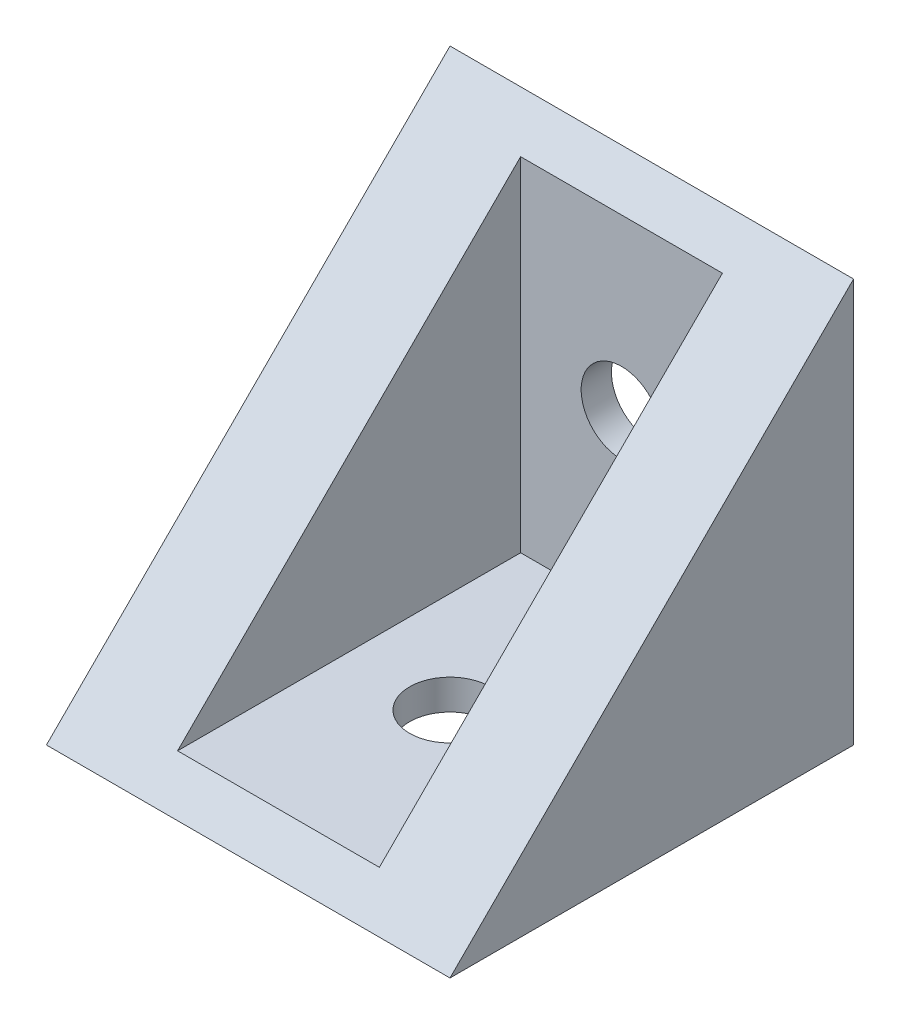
ISO-10303-21;
HEADER;
FILE_DESCRIPTION(('STEP AP214'),'2;1');
FILE_NAME('part.step','',(''),(''),'','','');
FILE_SCHEMA(('AUTOMOTIVE_DESIGN { 1 0 10303 214 1 1 1 1 }'));
ENDSEC;
DATA;
#1=APPLICATION_CONTEXT('core data for automotive mechanical design processes');
#2=APPLICATION_PROTOCOL_DEFINITION('international standard','automotive_design',2000,#1);
#3=PRODUCT_CONTEXT('',#1,'mechanical');
#4=PRODUCT('Part','Part','',(#3));
#5=PRODUCT_RELATED_PRODUCT_CATEGORY('part','',(#4));
#6=PRODUCT_DEFINITION_FORMATION('','',#4);
#7=PRODUCT_DEFINITION_CONTEXT('part definition',#1,'design');
#8=PRODUCT_DEFINITION('design','',#6,#7);
#9=PRODUCT_DEFINITION_SHAPE('','',#8);
#10=(LENGTH_UNIT() NAMED_UNIT(*) SI_UNIT(.MILLI.,.METRE.));
#11=(NAMED_UNIT(*) PLANE_ANGLE_UNIT() SI_UNIT($,.RADIAN.));
#12=(NAMED_UNIT(*) SI_UNIT($,.STERADIAN.) SOLID_ANGLE_UNIT());
#13=UNCERTAINTY_MEASURE_WITH_UNIT(LENGTH_MEASURE(1.E-05),#10,'distance_accuracy_value','');
#14=(GEOMETRIC_REPRESENTATION_CONTEXT(3) GLOBAL_UNCERTAINTY_ASSIGNED_CONTEXT((#13)) GLOBAL_UNIT_ASSIGNED_CONTEXT((#10,
#11,#12)) REPRESENTATION_CONTEXT('',''));
#15=CARTESIAN_POINT('',(0.,0.,0.));
#16=DIRECTION('',(0.,0.,1.));
#17=DIRECTION('',(1.,0.,0.));
#18=AXIS2_PLACEMENT_3D('',#15,#16,#17);
#19=CARTESIAN_POINT('',(20.,20.,0.));
#20=DIRECTION('',(0.,-0.707106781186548,-0.707106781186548));
#21=DIRECTION('',(0.,0.707106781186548,-0.707106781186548));
#22=AXIS2_PLACEMENT_3D('',#19,#20,#21);
#23=PLANE('',#22);
#24=DIRECTION('',(1.,0.,0.));
#25=VECTOR('',#24,1.);
#26=CARTESIAN_POINT('',(20.,1.5,18.5));
#27=LINE('',#26,#25);
#28=CARTESIAN_POINT('',(5.,1.5,18.5));
#29=VERTEX_POINT('',#28);
#30=CARTESIAN_POINT('',(15.,1.5,18.5));
#31=VERTEX_POINT('',#30);
#32=EDGE_CURVE('E113',#29,#31,#27,.T.);
#33=ORIENTED_EDGE('',*,*,#32,.F.);
#34=DIRECTION('',(0.,0.707106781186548,-0.707106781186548));
#35=VECTOR('',#34,1.);
#36=CARTESIAN_POINT('',(5.,20.,0.));
#37=LINE('',#36,#35);
#38=CARTESIAN_POINT('',(5.,18.5,1.5));
#39=VERTEX_POINT('',#38);
#40=EDGE_CURVE('E11',#29,#39,#37,.T.);
#41=ORIENTED_EDGE('',*,*,#40,.T.);
#42=DIRECTION('',(1.,0.,0.));
#43=VECTOR('',#42,1.);
#44=CARTESIAN_POINT('',(20.,18.5,1.5));
#45=LINE('',#44,#43);
#46=CARTESIAN_POINT('',(15.,18.5,1.5));
#47=VERTEX_POINT('',#46);
#48=EDGE_CURVE('E52',#39,#47,#45,.T.);
#49=ORIENTED_EDGE('',*,*,#48,.T.);
#50=DIRECTION('',(0.,-0.707106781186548,0.707106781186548));
#51=VECTOR('',#50,1.);
#52=CARTESIAN_POINT('',(15.,20.,0.));
#53=LINE('',#52,#51);
#54=EDGE_CURVE('E122',#47,#31,#53,.T.);
#55=ORIENTED_EDGE('',*,*,#54,.T.);
#56=EDGE_LOOP('',(#33,#41,#49,#55));
#57=FACE_BOUND('',#56,.T.);
#58=DIRECTION('',(0.,-0.707106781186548,0.707106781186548));
#59=VECTOR('',#58,1.);
#60=CARTESIAN_POINT('',(0.,20.,0.));
#61=LINE('',#60,#59);
#62=CARTESIAN_POINT('',(0.,20.,0.));
#63=VERTEX_POINT('',#62);
#64=CARTESIAN_POINT('',(0.,0.,20.));
#65=VERTEX_POINT('',#64);
#66=EDGE_CURVE('E132',#63,#65,#61,.T.);
#67=ORIENTED_EDGE('',*,*,#66,.T.);
#68=DIRECTION('',(-1.,0.,0.));
#69=VECTOR('',#68,1.);
#70=CARTESIAN_POINT('',(20.,0.,20.));
#71=LINE('',#70,#69);
#72=CARTESIAN_POINT('',(20.,0.,20.));
#73=VERTEX_POINT('',#72);
#74=EDGE_CURVE('E156',#73,#65,#71,.T.);
#75=ORIENTED_EDGE('',*,*,#74,.F.);
#76=DIRECTION('',(0.,-0.707106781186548,0.707106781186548));
#77=VECTOR('',#76,1.);
#78=CARTESIAN_POINT('',(20.,20.,0.));
#79=LINE('',#78,#77);
#80=CARTESIAN_POINT('',(20.,20.,0.));
#81=VERTEX_POINT('',#80);
#82=EDGE_CURVE('E139',#81,#73,#79,.T.);
#83=ORIENTED_EDGE('',*,*,#82,.F.);
#84=DIRECTION('',(-1.,0.,0.));
#85=VECTOR('',#84,1.);
#86=CARTESIAN_POINT('',(20.,20.,0.));
#87=LINE('',#86,#85);
#88=EDGE_CURVE('E141',#81,#63,#87,.T.);
#89=ORIENTED_EDGE('',*,*,#88,.T.);
#90=EDGE_LOOP('',(#67,#75,#83,#89));
#91=FACE_BOUND('',#90,.T.);
#92=ADVANCED_FACE('F44',(#57,#91),#23,.F.);
#93=CARTESIAN_POINT('',(20.,0.,20.));
#94=DIRECTION('',(0.,1.,0.));
#95=DIRECTION('',(0.,0.,1.));
#96=AXIS2_PLACEMENT_3D('',#93,#94,#95);
#97=PLANE('',#96);
#98=CARTESIAN_POINT('',(10.,0.,10.));
#99=DIRECTION('',(0.,1.,0.));
#100=DIRECTION('',(0.,0.,1.));
#101=AXIS2_PLACEMENT_3D('',#98,#99,#100);
#102=CIRCLE('',#101,2.);
#103=CARTESIAN_POINT('',(10.,0.,12.));
#104=VERTEX_POINT('',#103);
#105=EDGE_CURVE('E169',#104,#104,#102,.T.);
#106=ORIENTED_EDGE('',*,*,#105,.T.);
#107=EDGE_LOOP('',(#106));
#108=FACE_BOUND('',#107,.T.);
#109=DIRECTION('',(0.,0.,-1.));
#110=VECTOR('',#109,1.);
#111=CARTESIAN_POINT('',(0.,0.,20.));
#112=LINE('',#111,#110);
#113=CARTESIAN_POINT('',(0.,0.,0.));
#114=VERTEX_POINT('',#113);
#115=EDGE_CURVE('E150',#65,#114,#112,.T.);
#116=ORIENTED_EDGE('',*,*,#115,.T.);
#117=DIRECTION('',(-1.,0.,0.));
#118=VECTOR('',#117,1.);
#119=CARTESIAN_POINT('',(20.,0.,0.));
#120=LINE('',#119,#118);
#121=CARTESIAN_POINT('',(20.,0.,0.));
#122=VERTEX_POINT('',#121);
#123=EDGE_CURVE('E152',#122,#114,#120,.T.);
#124=ORIENTED_EDGE('',*,*,#123,.F.);
#125=DIRECTION('',(0.,0.,-1.));
#126=VECTOR('',#125,1.);
#127=CARTESIAN_POINT('',(20.,0.,20.));
#128=LINE('',#127,#126);
#129=EDGE_CURVE('E91',#73,#122,#128,.T.);
#130=ORIENTED_EDGE('',*,*,#129,.F.);
#131=ORIENTED_EDGE('',*,*,#74,.T.);
#132=EDGE_LOOP('',(#116,#124,#130,#131));
#133=FACE_BOUND('',#132,.T.);
#134=ADVANCED_FACE('F205',(#108,#133),#97,.F.);
#135=CARTESIAN_POINT('',(20.,0.,0.));
#136=DIRECTION('',(0.,0.,1.));
#137=DIRECTION('',(1.,0.,0.));
#138=AXIS2_PLACEMENT_3D('',#135,#136,#137);
#139=PLANE('',#138);
#140=CARTESIAN_POINT('',(10.,10.,0.));
#141=DIRECTION('',(0.,0.,1.));
#142=DIRECTION('',(1.,0.,0.));
#143=AXIS2_PLACEMENT_3D('',#140,#141,#142);
#144=CIRCLE('',#143,2.);
#145=CARTESIAN_POINT('',(12.,10.,0.));
#146=VERTEX_POINT('',#145);
#147=EDGE_CURVE('E178',#146,#146,#144,.T.);
#148=ORIENTED_EDGE('',*,*,#147,.T.);
#149=EDGE_LOOP('',(#148));
#150=FACE_BOUND('',#149,.T.);
#151=DIRECTION('',(0.,1.,0.));
#152=VECTOR('',#151,1.);
#153=CARTESIAN_POINT('',(0.,0.,0.));
#154=LINE('',#153,#152);
#155=EDGE_CURVE('E86',#114,#63,#154,.T.);
#156=ORIENTED_EDGE('',*,*,#155,.T.);
#157=ORIENTED_EDGE('',*,*,#88,.F.);
#158=DIRECTION('',(0.,1.,0.));
#159=VECTOR('',#158,1.);
#160=CARTESIAN_POINT('',(20.,0.,0.));
#161=LINE('',#160,#159);
#162=EDGE_CURVE('E67',#122,#81,#161,.T.);
#163=ORIENTED_EDGE('',*,*,#162,.F.);
#164=ORIENTED_EDGE('',*,*,#123,.T.);
#165=EDGE_LOOP('',(#156,#157,#163,#164));
#166=FACE_BOUND('',#165,.T.);
#167=ADVANCED_FACE('F206',(#150,#166),#139,.F.);
#168=CARTESIAN_POINT('',(20.,0.,0.));
#169=DIRECTION('',(1.,0.,0.));
#170=DIRECTION('',(0.,0.,-1.));
#171=AXIS2_PLACEMENT_3D('',#168,#169,#170);
#172=PLANE('',#171);
#173=ORIENTED_EDGE('',*,*,#82,.T.);
#174=ORIENTED_EDGE('',*,*,#129,.T.);
#175=ORIENTED_EDGE('',*,*,#162,.T.);
#176=EDGE_LOOP('',(#173,#174,#175));
#177=FACE_BOUND('',#176,.T.);
#178=ADVANCED_FACE('F214',(#177),#172,.T.);
#179=CARTESIAN_POINT('',(0.,0.,0.));
#180=DIRECTION('',(1.,0.,0.));
#181=DIRECTION('',(0.,0.,-1.));
#182=AXIS2_PLACEMENT_3D('',#179,#180,#181);
#183=PLANE('',#182);
#184=ORIENTED_EDGE('',*,*,#66,.F.);
#185=ORIENTED_EDGE('',*,*,#155,.F.);
#186=ORIENTED_EDGE('',*,*,#115,.F.);
#187=EDGE_LOOP('',(#184,#185,#186));
#188=FACE_BOUND('',#187,.T.);
#189=ADVANCED_FACE('F197',(#188),#183,.F.);
#190=CARTESIAN_POINT('',(5.,1.5,1.5));
#191=DIRECTION('',(-1.,0.,0.));
#192=DIRECTION('',(0.,0.,1.));
#193=AXIS2_PLACEMENT_3D('',#190,#191,#192);
#194=PLANE('',#193);
#195=DIRECTION('',(0.,0.,1.));
#196=VECTOR('',#195,1.);
#197=CARTESIAN_POINT('',(5.,1.5,1.5));
#198=LINE('',#197,#196);
#199=CARTESIAN_POINT('',(5.,1.5,1.5));
#200=VERTEX_POINT('',#199);
#201=EDGE_CURVE('E58',#200,#29,#198,.T.);
#202=ORIENTED_EDGE('',*,*,#201,.F.);
#203=DIRECTION('',(0.,1.,0.));
#204=VECTOR('',#203,1.);
#205=CARTESIAN_POINT('',(5.,1.5,1.5));
#206=LINE('',#205,#204);
#207=EDGE_CURVE('E123',#200,#39,#206,.T.);
#208=ORIENTED_EDGE('',*,*,#207,.T.);
#209=ORIENTED_EDGE('',*,*,#40,.F.);
#210=EDGE_LOOP('',(#202,#208,#209));
#211=FACE_BOUND('',#210,.T.);
#212=ADVANCED_FACE('F170',(#211),#194,.F.);
#213=CARTESIAN_POINT('',(5.,1.5,1.5));
#214=DIRECTION('',(0.,0.,-1.));
#215=DIRECTION('',(-1.,0.,0.));
#216=AXIS2_PLACEMENT_3D('',#213,#214,#215);
#217=PLANE('',#216);
#218=CARTESIAN_POINT('',(10.,10.,1.5));
#219=DIRECTION('',(0.,0.,1.));
#220=DIRECTION('',(1.,0.,0.));
#221=AXIS2_PLACEMENT_3D('',#218,#219,#220);
#222=CIRCLE('',#221,2.);
#223=CARTESIAN_POINT('',(12.,10.,1.5));
#224=VERTEX_POINT('',#223);
#225=EDGE_CURVE('E185',#224,#224,#222,.T.);
#226=ORIENTED_EDGE('',*,*,#225,.F.);
#227=EDGE_LOOP('',(#226));
#228=FACE_BOUND('',#227,.T.);
#229=ORIENTED_EDGE('',*,*,#207,.F.);
#230=DIRECTION('',(-1.,0.,0.));
#231=VECTOR('',#230,1.);
#232=CARTESIAN_POINT('',(5.,1.5,1.5));
#233=LINE('',#232,#231);
#234=CARTESIAN_POINT('',(15.,1.5,1.5));
#235=VERTEX_POINT('',#234);
#236=EDGE_CURVE('E111',#235,#200,#233,.T.);
#237=ORIENTED_EDGE('',*,*,#236,.F.);
#238=DIRECTION('',(0.,1.,0.));
#239=VECTOR('',#238,1.);
#240=CARTESIAN_POINT('',(15.,1.5,1.5));
#241=LINE('',#240,#239);
#242=EDGE_CURVE('E118',#235,#47,#241,.T.);
#243=ORIENTED_EDGE('',*,*,#242,.T.);
#244=ORIENTED_EDGE('',*,*,#48,.F.);
#245=EDGE_LOOP('',(#229,#237,#243,#244));
#246=FACE_BOUND('',#245,.T.);
#247=ADVANCED_FACE('F130',(#228,#246),#217,.F.);
#248=CARTESIAN_POINT('',(15.,1.5,1.5));
#249=DIRECTION('',(1.,0.,0.));
#250=DIRECTION('',(0.,0.,-1.));
#251=AXIS2_PLACEMENT_3D('',#248,#249,#250);
#252=PLANE('',#251);
#253=ORIENTED_EDGE('',*,*,#242,.F.);
#254=DIRECTION('',(0.,0.,-1.));
#255=VECTOR('',#254,1.);
#256=CARTESIAN_POINT('',(15.,1.5,1.5));
#257=LINE('',#256,#255);
#258=EDGE_CURVE('E110',#31,#235,#257,.T.);
#259=ORIENTED_EDGE('',*,*,#258,.F.);
#260=ORIENTED_EDGE('',*,*,#54,.F.);
#261=EDGE_LOOP('',(#253,#259,#260));
#262=FACE_BOUND('',#261,.T.);
#263=ADVANCED_FACE('F119',(#262),#252,.F.);
#264=CARTESIAN_POINT('',(0.,1.5,0.));
#265=DIRECTION('',(0.,1.,0.));
#266=DIRECTION('',(0.,0.,1.));
#267=AXIS2_PLACEMENT_3D('',#264,#265,#266);
#268=PLANE('',#267);
#269=CARTESIAN_POINT('',(10.,1.5,10.));
#270=DIRECTION('',(0.,1.,0.));
#271=DIRECTION('',(0.,0.,1.));
#272=AXIS2_PLACEMENT_3D('',#269,#270,#271);
#273=CIRCLE('',#272,2.);
#274=CARTESIAN_POINT('',(10.,1.5,12.));
#275=VERTEX_POINT('',#274);
#276=EDGE_CURVE('E175',#275,#275,#273,.T.);
#277=ORIENTED_EDGE('',*,*,#276,.F.);
#278=EDGE_LOOP('',(#277));
#279=FACE_BOUND('',#278,.T.);
#280=ORIENTED_EDGE('',*,*,#32,.T.);
#281=ORIENTED_EDGE('',*,*,#258,.T.);
#282=ORIENTED_EDGE('',*,*,#236,.T.);
#283=ORIENTED_EDGE('',*,*,#201,.T.);
#284=EDGE_LOOP('',(#280,#281,#282,#283));
#285=FACE_BOUND('',#284,.T.);
#286=ADVANCED_FACE('F107',(#279,#285),#268,.T.);
#287=CARTESIAN_POINT('',(10.,-14.5,10.));
#288=DIRECTION('',(0.,1.,0.));
#289=DIRECTION('',(0.,0.,1.));
#290=AXIS2_PLACEMENT_3D('',#287,#288,#289);
#291=CYLINDRICAL_SURFACE('',#290,2.);
#292=ORIENTED_EDGE('',*,*,#276,.T.);
#293=EDGE_LOOP('',(#292));
#294=FACE_BOUND('',#293,.T.);
#295=ORIENTED_EDGE('',*,*,#105,.F.);
#296=EDGE_LOOP('',(#295));
#297=FACE_BOUND('',#296,.T.);
#298=ADVANCED_FACE('F257',(#294,#297),#291,.F.);
#299=CARTESIAN_POINT('',(10.,10.,-14.5));
#300=DIRECTION('',(0.,0.,1.));
#301=DIRECTION('',(1.,0.,0.));
#302=AXIS2_PLACEMENT_3D('',#299,#300,#301);
#303=CYLINDRICAL_SURFACE('',#302,2.);
#304=ORIENTED_EDGE('',*,*,#225,.T.);
#305=EDGE_LOOP('',(#304));
#306=FACE_BOUND('',#305,.T.);
#307=ORIENTED_EDGE('',*,*,#147,.F.);
#308=EDGE_LOOP('',(#307));
#309=FACE_BOUND('',#308,.T.);
#310=ADVANCED_FACE('F190',(#306,#309),#303,.F.);
#311=CLOSED_SHELL('',(#92,#134,#167,#178,#189,#212,#247,#263,#286,#298,#310));
#312=MANIFOLD_SOLID_BREP('B2',#311);
#313=ADVANCED_BREP_SHAPE_REPRESENTATION('',(#18,#312),#14);
#314=SHAPE_DEFINITION_REPRESENTATION(#9,#313);
ENDSEC;
END-ISO-10303-21;
